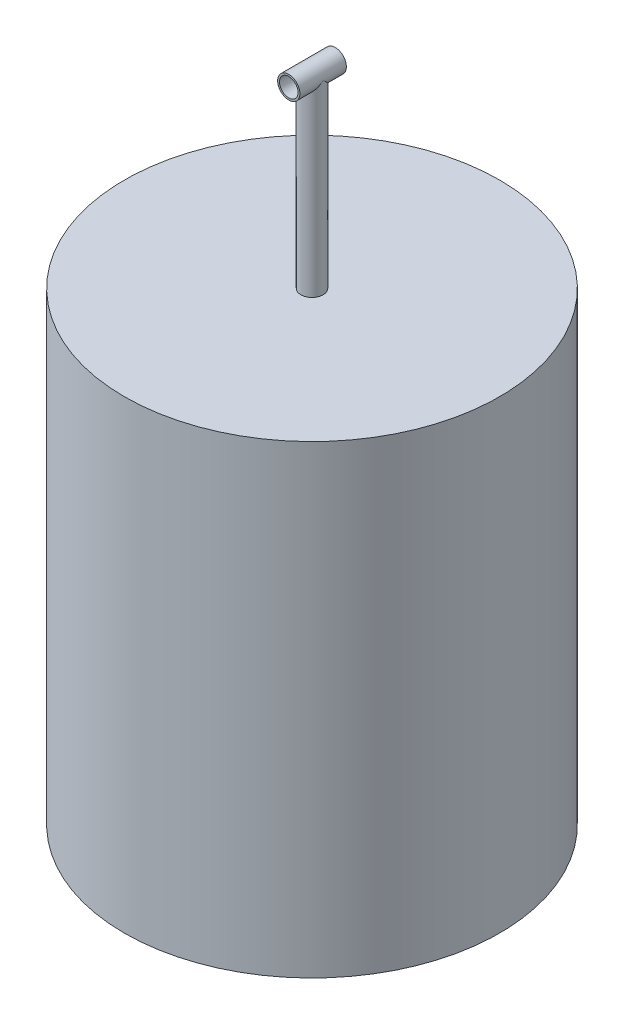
from build123d import *

# Parameters (mm, degrees)
ESQUISSE2_R             = 201.95
EXTRUSION2_DEPTH        = 500
ESQUISSE4_R             = 12
ESQUISSE4_R_2           = 10
EXTRU_MINCE2_DEPTH      = 25
EXTRU_MINCE1_REACH      = 577.819
EXTRU_MINCE1_END_RADIUS = 12
ESQUISSE3_R             = 12
ESQUISSE3_R_2           = 10


with BuildPart() as part:
    # Esquisse2 → Extrusion2 (new body)
    with BuildSketch(Plane(origin=(0, 0, 0), x_dir=(1, 0, 0), z_dir=(0, 1, 0))):
        with Locations(Location((0, 0, 0), (0, 0, 270))):
            Circle(ESQUISSE2_R)
    extrude(amount=-EXTRUSION2_DEPTH)

    # Extru.-Mince1: up to this cylinder (the profile starts outside it)
    extru_mince1_end = Plane(origin=(0, 200, 0), z_dir=(0, 0, -1)) * Cylinder(EXTRU_MINCE1_END_RADIUS, 1180.638, mode=Mode.PRIVATE)
    # Esquisse3 → Extru.-Mince1 (add, up to the surface)
    with BuildSketch(Plane(origin=(0, 0, 0), x_dir=(-1, 0, 0), z_dir=(0, 1, 0)), mode=Mode.PRIVATE) as extru_mince1_sk1:
        Circle(ESQUISSE3_R)
        Circle(ESQUISSE3_R_2, mode=Mode.SUBTRACT)
    extru_mince1_tool1 = extrude(extru_mince1_sk1.sketch, amount=EXTRU_MINCE1_REACH, mode=Mode.PRIVATE) - extru_mince1_end
    add(extru_mince1_tool1.solids().sort_by_distance((11.660589, 0, 0))[0])


with BuildPart() as body_2:
    # Esquisse4 → Extru.-Mince2 (new, symmetric)
    with BuildSketch(Plane.XY):
        with Locations((0, 200)):
            Circle(ESQUISSE4_R)
        with Locations((0, 200)):
            Circle(ESQUISSE4_R_2, mode=Mode.SUBTRACT)
    extrude(amount=EXTRU_MINCE2_DEPTH, both=True)


solid = Compound([part.part, body_2.part])
